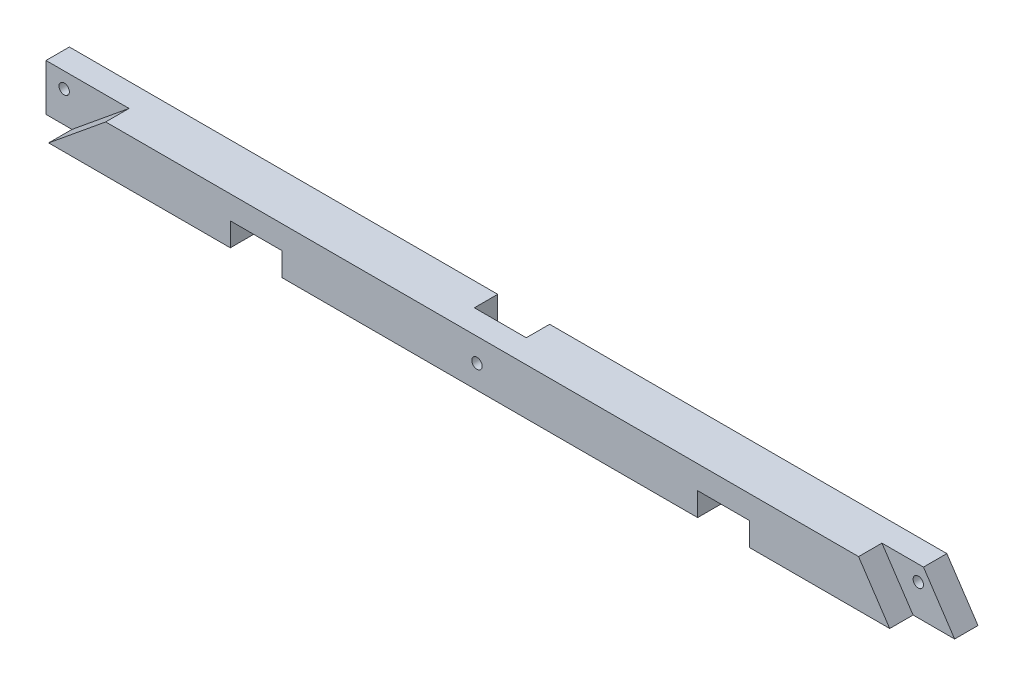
ISO-10303-21;
HEADER;
FILE_DESCRIPTION(('STEP AP214'),'2;1');
FILE_NAME('part.step','',(''),(''),'','','');
FILE_SCHEMA(('AUTOMOTIVE_DESIGN { 1 0 10303 214 1 1 1 1 }'));
ENDSEC;
DATA;
#1=APPLICATION_CONTEXT('core data for automotive mechanical design processes');
#2=APPLICATION_PROTOCOL_DEFINITION('international standard','automotive_design',2000,#1);
#3=PRODUCT_CONTEXT('',#1,'mechanical');
#4=PRODUCT('Part','Part','',(#3));
#5=PRODUCT_RELATED_PRODUCT_CATEGORY('part','',(#4));
#6=PRODUCT_DEFINITION_FORMATION('','',#4);
#7=PRODUCT_DEFINITION_CONTEXT('part definition',#1,'design');
#8=PRODUCT_DEFINITION('design','',#6,#7);
#9=PRODUCT_DEFINITION_SHAPE('','',#8);
#10=(LENGTH_UNIT() NAMED_UNIT(*) SI_UNIT(.MILLI.,.METRE.));
#11=(NAMED_UNIT(*) PLANE_ANGLE_UNIT() SI_UNIT($,.RADIAN.));
#12=(NAMED_UNIT(*) SI_UNIT($,.STERADIAN.) SOLID_ANGLE_UNIT());
#13=UNCERTAINTY_MEASURE_WITH_UNIT(LENGTH_MEASURE(1.E-05),#10,'distance_accuracy_value','');
#14=(GEOMETRIC_REPRESENTATION_CONTEXT(3) GLOBAL_UNCERTAINTY_ASSIGNED_CONTEXT((#13)) GLOBAL_UNIT_ASSIGNED_CONTEXT((#10,
#11,#12)) REPRESENTATION_CONTEXT('',''));
#15=CARTESIAN_POINT('',(0.,0.,0.));
#16=DIRECTION('',(0.,0.,1.));
#17=DIRECTION('',(1.,0.,0.));
#18=AXIS2_PLACEMENT_3D('',#15,#16,#17);
#19=CARTESIAN_POINT('',(0.,0.,9.));
#20=DIRECTION('',(0.,1.,0.));
#21=DIRECTION('',(0.,0.,1.));
#22=AXIS2_PLACEMENT_3D('',#19,#20,#21);
#23=PLANE('',#22);
#24=DIRECTION('',(1.,0.,0.));
#25=VECTOR('',#24,1.);
#26=CARTESIAN_POINT('',(0.,0.,0.));
#27=LINE('',#26,#25);
#28=CARTESIAN_POINT('',(92.5,0.,0.));
#29=VERTEX_POINT('',#28);
#30=CARTESIAN_POINT('',(130.,0.,0.));
#31=VERTEX_POINT('',#30);
#32=EDGE_CURVE('E329',#29,#31,#27,.T.);
#33=ORIENTED_EDGE('',*,*,#32,.T.);
#34=DIRECTION('',(0.,0.,-1.));
#35=VECTOR('',#34,1.);
#36=CARTESIAN_POINT('',(130.,0.,9.));
#37=LINE('',#36,#35);
#38=CARTESIAN_POINT('',(130.,0.,9.));
#39=VERTEX_POINT('',#38);
#40=EDGE_CURVE('E197',#39,#31,#37,.T.);
#41=ORIENTED_EDGE('',*,*,#40,.F.);
#42=DIRECTION('',(1.,0.,0.));
#43=VECTOR('',#42,1.);
#44=CARTESIAN_POINT('',(0.,0.,9.));
#45=LINE('',#44,#43);
#46=CARTESIAN_POINT('',(50.,0.,9.));
#47=VERTEX_POINT('',#46);
#48=EDGE_CURVE('E188',#47,#39,#45,.T.);
#49=ORIENTED_EDGE('',*,*,#48,.F.);
#50=DIRECTION('',(0.,0.,-1.));
#51=VECTOR('',#50,1.);
#52=CARTESIAN_POINT('',(50.,0.,9.));
#53=LINE('',#52,#51);
#54=CARTESIAN_POINT('',(50.,0.,0.));
#55=VERTEX_POINT('',#54);
#56=EDGE_CURVE('E221',#47,#55,#53,.T.);
#57=ORIENTED_EDGE('',*,*,#56,.T.);
#58=CARTESIAN_POINT('',(82.5,0.,0.));
#59=VERTEX_POINT('',#58);
#60=EDGE_CURVE('E328',#55,#59,#27,.T.);
#61=ORIENTED_EDGE('',*,*,#60,.T.);
#62=DIRECTION('',(0.,0.,-1.));
#63=VECTOR('',#62,1.);
#64=CARTESIAN_POINT('',(82.5,0.,4.5));
#65=LINE('',#64,#63);
#66=CARTESIAN_POINT('',(82.5,0.,4.5));
#67=VERTEX_POINT('',#66);
#68=EDGE_CURVE('E255',#67,#59,#65,.T.);
#69=ORIENTED_EDGE('',*,*,#68,.F.);
#70=DIRECTION('',(-1.,0.,0.));
#71=VECTOR('',#70,1.);
#72=CARTESIAN_POINT('',(92.5,0.,4.5));
#73=LINE('',#72,#71);
#74=CARTESIAN_POINT('',(92.5,0.,4.5));
#75=VERTEX_POINT('',#74);
#76=EDGE_CURVE('E236',#75,#67,#73,.T.);
#77=ORIENTED_EDGE('',*,*,#76,.F.);
#78=DIRECTION('',(0.,0.,-1.));
#79=VECTOR('',#78,1.);
#80=CARTESIAN_POINT('',(92.5,0.,4.5));
#81=LINE('',#80,#79);
#82=EDGE_CURVE('E246',#75,#29,#81,.T.);
#83=ORIENTED_EDGE('',*,*,#82,.T.);
#84=EDGE_LOOP('',(#33,#41,#49,#57,#61,#69,#77,#83));
#85=FACE_BOUND('',#84,.T.);
#86=ADVANCED_FACE('F30',(#85),#23,.F.);
#87=CARTESIAN_POINT('',(0.,0.,0.));
#88=VERTEX_POINT('',#87);
#89=CARTESIAN_POINT('',(40.,0.,0.));
#90=VERTEX_POINT('',#89);
#91=EDGE_CURVE('E324',#88,#90,#27,.T.);
#92=ORIENTED_EDGE('',*,*,#91,.T.);
#93=DIRECTION('',(0.,0.,-1.));
#94=VECTOR('',#93,1.);
#95=CARTESIAN_POINT('',(40.,0.,9.));
#96=LINE('',#95,#94);
#97=CARTESIAN_POINT('',(40.,0.,9.));
#98=VERTEX_POINT('',#97);
#99=EDGE_CURVE('E218',#98,#90,#96,.T.);
#100=ORIENTED_EDGE('',*,*,#99,.F.);
#101=CARTESIAN_POINT('',(5.,0.,9.));
#102=VERTEX_POINT('',#101);
#103=EDGE_CURVE('E314',#102,#98,#45,.T.);
#104=ORIENTED_EDGE('',*,*,#103,.F.);
#105=DIRECTION('',(0.,0.,1.));
#106=VECTOR('',#105,1.);
#107=CARTESIAN_POINT('',(5.,0.,4.5));
#108=LINE('',#107,#106);
#109=CARTESIAN_POINT('',(5.,0.,4.5));
#110=VERTEX_POINT('',#109);
#111=EDGE_CURVE('E306',#110,#102,#108,.T.);
#112=ORIENTED_EDGE('',*,*,#111,.F.);
#113=DIRECTION('',(1.,0.,0.));
#114=VECTOR('',#113,1.);
#115=CARTESIAN_POINT('',(5.,0.,4.5));
#116=LINE('',#115,#114);
#117=CARTESIAN_POINT('',(0.,0.,4.5));
#118=VERTEX_POINT('',#117);
#119=EDGE_CURVE('E298',#118,#110,#116,.T.);
#120=ORIENTED_EDGE('',*,*,#119,.F.);
#121=DIRECTION('',(0.,0.,-1.));
#122=VECTOR('',#121,1.);
#123=CARTESIAN_POINT('',(0.,0.,9.));
#124=LINE('',#123,#122);
#125=EDGE_CURVE('E11',#118,#88,#124,.T.);
#126=ORIENTED_EDGE('',*,*,#125,.T.);
#127=EDGE_LOOP('',(#92,#100,#104,#112,#120,#126));
#128=FACE_BOUND('',#127,.T.);
#129=ADVANCED_FACE('F377',(#128),#23,.F.);
#130=CARTESIAN_POINT('',(0.,9.,0.));
#131=DIRECTION('',(0.,0.,-1.));
#132=DIRECTION('',(-1.,0.,0.));
#133=AXIS2_PLACEMENT_3D('',#130,#131,#132);
#134=PLANE('',#133);
#135=DIRECTION('',(0.,1.,0.));
#136=VECTOR('',#135,1.);
#137=CARTESIAN_POINT('',(130.,0.,0.));
#138=LINE('',#137,#136);
#139=CARTESIAN_POINT('',(130.,4.5,0.));
#140=VERTEX_POINT('',#139);
#141=EDGE_CURVE('E172',#31,#140,#138,.T.);
#142=ORIENTED_EDGE('',*,*,#141,.F.);
#143=ORIENTED_EDGE('',*,*,#32,.F.);
#144=DIRECTION('',(0.,-1.,0.));
#145=VECTOR('',#144,1.);
#146=CARTESIAN_POINT('',(92.5,0.,0.));
#147=LINE('',#146,#145);
#148=CARTESIAN_POINT('',(92.5,9.,0.));
#149=VERTEX_POINT('',#148);
#150=EDGE_CURVE('E230',#149,#29,#147,.T.);
#151=ORIENTED_EDGE('',*,*,#150,.F.);
#152=DIRECTION('',(-1.,0.,0.));
#153=VECTOR('',#152,1.);
#154=CARTESIAN_POINT('',(0.,9.,0.));
#155=LINE('',#154,#153);
#156=CARTESIAN_POINT('',(169.,9.,0.));
#157=VERTEX_POINT('',#156);
#158=EDGE_CURVE('E330',#157,#149,#155,.T.);
#159=ORIENTED_EDGE('',*,*,#158,.F.);
#160=DIRECTION('',(0.55470019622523,-0.832050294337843,0.));
#161=VECTOR('',#160,1.);
#162=CARTESIAN_POINT('',(169.,9.,0.));
#163=LINE('',#162,#161);
#164=CARTESIAN_POINT('',(175.,0.,0.));
#165=VERTEX_POINT('',#164);
#166=EDGE_CURVE('E282',#157,#165,#163,.T.);
#167=ORIENTED_EDGE('',*,*,#166,.T.);
#168=CARTESIAN_POINT('',(140.,0.,0.));
#169=VERTEX_POINT('',#168);
#170=EDGE_CURVE('E323',#169,#165,#27,.T.);
#171=ORIENTED_EDGE('',*,*,#170,.F.);
#172=DIRECTION('',(0.,-1.,0.));
#173=VECTOR('',#172,1.);
#174=CARTESIAN_POINT('',(140.,0.,0.));
#175=LINE('',#174,#173);
#176=CARTESIAN_POINT('',(140.,4.5,0.));
#177=VERTEX_POINT('',#176);
#178=EDGE_CURVE('E189',#177,#169,#175,.T.);
#179=ORIENTED_EDGE('',*,*,#178,.F.);
#180=DIRECTION('',(1.,0.,0.));
#181=VECTOR('',#180,1.);
#182=CARTESIAN_POINT('',(130.,4.5,0.));
#183=LINE('',#182,#181);
#184=EDGE_CURVE('E191',#140,#177,#183,.T.);
#185=ORIENTED_EDGE('',*,*,#184,.F.);
#186=EDGE_LOOP('',(#142,#143,#151,#159,#167,#171,#179,#185));
#187=FACE_BOUND('',#186,.T.);
#188=CARTESIAN_POINT('',(168.,6.,0.));
#189=DIRECTION('',(0.,0.,1.));
#190=DIRECTION('',(1.,0.,0.));
#191=AXIS2_PLACEMENT_3D('',#188,#189,#190);
#192=CIRCLE('',#191,0.999999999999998);
#193=CARTESIAN_POINT('',(169.,6.,0.));
#194=VERTEX_POINT('',#193);
#195=EDGE_CURVE('E260',#194,#194,#192,.T.);
#196=ORIENTED_EDGE('',*,*,#195,.T.);
#197=EDGE_LOOP('',(#196));
#198=FACE_BOUND('',#197,.T.);
#199=ADVANCED_FACE('F345',(#187,#198),#134,.T.);
#200=CARTESIAN_POINT('',(169.,9.,0.));
#201=DIRECTION('',(-0.832050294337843,-0.554700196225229,0.));
#202=DIRECTION('',(0.554700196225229,-0.832050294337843,0.));
#203=AXIS2_PLACEMENT_3D('',#200,#201,#202);
#204=PLANE('',#203);
#205=DIRECTION('',(-0.55470019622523,0.832050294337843,0.));
#206=VECTOR('',#205,1.);
#207=CARTESIAN_POINT('',(175.,0.,4.5));
#208=LINE('',#207,#206);
#209=CARTESIAN_POINT('',(175.,0.,4.5));
#210=VERTEX_POINT('',#209);
#211=CARTESIAN_POINT('',(169.,9.,4.5));
#212=VERTEX_POINT('',#211);
#213=EDGE_CURVE('E266',#210,#212,#208,.T.);
#214=ORIENTED_EDGE('',*,*,#213,.F.);
#215=DIRECTION('',(0.,0.,-1.));
#216=VECTOR('',#215,1.);
#217=CARTESIAN_POINT('',(175.,0.,9.));
#218=LINE('',#217,#216);
#219=EDGE_CURVE('E38',#210,#165,#218,.T.);
#220=ORIENTED_EDGE('',*,*,#219,.T.);
#221=ORIENTED_EDGE('',*,*,#166,.F.);
#222=DIRECTION('',(0.,0.,1.));
#223=VECTOR('',#222,1.);
#224=CARTESIAN_POINT('',(169.,9.,0.));
#225=LINE('',#224,#223);
#226=EDGE_CURVE('E286',#157,#212,#225,.T.);
#227=ORIENTED_EDGE('',*,*,#226,.T.);
#228=EDGE_LOOP('',(#214,#220,#221,#227));
#229=FACE_BOUND('',#228,.T.);
#230=ADVANCED_FACE('F338',(#229),#204,.F.);
#231=CARTESIAN_POINT('',(0.,0.,9.));
#232=DIRECTION('',(1.,0.,0.));
#233=DIRECTION('',(0.,0.,-1.));
#234=AXIS2_PLACEMENT_3D('',#231,#232,#233);
#235=PLANE('',#234);
#236=ORIENTED_EDGE('',*,*,#125,.F.);
#237=DIRECTION('',(0.,-1.,0.));
#238=VECTOR('',#237,1.);
#239=CARTESIAN_POINT('',(0.,0.,4.5));
#240=LINE('',#239,#238);
#241=CARTESIAN_POINT('',(0.,9.,4.5));
#242=VERTEX_POINT('',#241);
#243=EDGE_CURVE('E296',#242,#118,#240,.T.);
#244=ORIENTED_EDGE('',*,*,#243,.F.);
#245=DIRECTION('',(0.,0.,-1.));
#246=VECTOR('',#245,1.);
#247=CARTESIAN_POINT('',(0.,9.,9.));
#248=LINE('',#247,#246);
#249=CARTESIAN_POINT('',(0.,9.,0.));
#250=VERTEX_POINT('',#249);
#251=EDGE_CURVE('E320',#242,#250,#248,.T.);
#252=ORIENTED_EDGE('',*,*,#251,.T.);
#253=DIRECTION('',(0.,-1.,0.));
#254=VECTOR('',#253,1.);
#255=CARTESIAN_POINT('',(0.,0.,0.));
#256=LINE('',#255,#254);
#257=EDGE_CURVE('E312',#250,#88,#256,.T.);
#258=ORIENTED_EDGE('',*,*,#257,.T.);
#259=EDGE_LOOP('',(#236,#244,#252,#258));
#260=FACE_BOUND('',#259,.T.);
#261=ADVANCED_FACE('F32',(#260),#235,.F.);
#262=CARTESIAN_POINT('',(140.,0.,9.));
#263=VERTEX_POINT('',#262);
#264=CARTESIAN_POINT('',(167.,0.,9.));
#265=VERTEX_POINT('',#264);
#266=EDGE_CURVE('E318',#263,#265,#45,.T.);
#267=ORIENTED_EDGE('',*,*,#266,.F.);
#268=DIRECTION('',(0.,0.,-1.));
#269=VECTOR('',#268,1.);
#270=CARTESIAN_POINT('',(140.,0.,9.));
#271=LINE('',#270,#269);
#272=EDGE_CURVE('E199',#263,#169,#271,.T.);
#273=ORIENTED_EDGE('',*,*,#272,.T.);
#274=ORIENTED_EDGE('',*,*,#170,.T.);
#275=ORIENTED_EDGE('',*,*,#219,.F.);
#276=DIRECTION('',(1.,0.,0.));
#277=VECTOR('',#276,1.);
#278=CARTESIAN_POINT('',(167.,0.,4.5));
#279=LINE('',#278,#277);
#280=CARTESIAN_POINT('',(167.,0.,4.5));
#281=VERTEX_POINT('',#280);
#282=EDGE_CURVE('E274',#281,#210,#279,.T.);
#283=ORIENTED_EDGE('',*,*,#282,.F.);
#284=DIRECTION('',(0.,0.,1.));
#285=VECTOR('',#284,1.);
#286=CARTESIAN_POINT('',(167.,0.,4.5));
#287=LINE('',#286,#285);
#288=EDGE_CURVE('E279',#281,#265,#287,.T.);
#289=ORIENTED_EDGE('',*,*,#288,.T.);
#290=EDGE_LOOP('',(#267,#273,#274,#275,#283,#289));
#291=FACE_BOUND('',#290,.T.);
#292=ADVANCED_FACE('F360',(#291),#23,.F.);
#293=CARTESIAN_POINT('',(0.,9.,9.));
#294=DIRECTION('',(0.,-1.,0.));
#295=DIRECTION('',(0.,0.,-1.));
#296=AXIS2_PLACEMENT_3D('',#293,#294,#295);
#297=PLANE('',#296);
#298=ORIENTED_EDGE('',*,*,#158,.T.);
#299=DIRECTION('',(0.,0.,-1.));
#300=VECTOR('',#299,1.);
#301=CARTESIAN_POINT('',(92.5,9.,4.5));
#302=LINE('',#301,#300);
#303=CARTESIAN_POINT('',(92.5,9.,4.5));
#304=VERTEX_POINT('',#303);
#305=EDGE_CURVE('E249',#304,#149,#302,.T.);
#306=ORIENTED_EDGE('',*,*,#305,.F.);
#307=DIRECTION('',(1.,0.,0.));
#308=VECTOR('',#307,1.);
#309=CARTESIAN_POINT('',(92.5,9.,4.5));
#310=LINE('',#309,#308);
#311=CARTESIAN_POINT('',(82.5,9.,4.5));
#312=VERTEX_POINT('',#311);
#313=EDGE_CURVE('E243',#312,#304,#310,.T.);
#314=ORIENTED_EDGE('',*,*,#313,.F.);
#315=DIRECTION('',(0.,0.,-1.));
#316=VECTOR('',#315,1.);
#317=CARTESIAN_POINT('',(82.5,9.,4.5));
#318=LINE('',#317,#316);
#319=CARTESIAN_POINT('',(82.5,9.,0.));
#320=VERTEX_POINT('',#319);
#321=EDGE_CURVE('E252',#312,#320,#318,.T.);
#322=ORIENTED_EDGE('',*,*,#321,.T.);
#323=EDGE_CURVE('E327',#320,#250,#155,.T.);
#324=ORIENTED_EDGE('',*,*,#323,.T.);
#325=ORIENTED_EDGE('',*,*,#251,.F.);
#326=DIRECTION('',(-1.,0.,0.));
#327=VECTOR('',#326,1.);
#328=CARTESIAN_POINT('',(0.,9.,4.5));
#329=LINE('',#328,#327);
#330=CARTESIAN_POINT('',(16.,9.,4.5));
#331=VERTEX_POINT('',#330);
#332=EDGE_CURVE('E304',#331,#242,#329,.T.);
#333=ORIENTED_EDGE('',*,*,#332,.F.);
#334=DIRECTION('',(0.,0.,1.));
#335=VECTOR('',#334,1.);
#336=CARTESIAN_POINT('',(16.,9.,4.5));
#337=LINE('',#336,#335);
#338=CARTESIAN_POINT('',(16.,9.,9.));
#339=VERTEX_POINT('',#338);
#340=EDGE_CURVE('E309',#331,#339,#337,.T.);
#341=ORIENTED_EDGE('',*,*,#340,.T.);
#342=DIRECTION('',(-1.,0.,0.));
#343=VECTOR('',#342,1.);
#344=CARTESIAN_POINT('',(0.,9.,9.));
#345=LINE('',#344,#343);
#346=CARTESIAN_POINT('',(161.,9.,9.));
#347=VERTEX_POINT('',#346);
#348=EDGE_CURVE('E317',#347,#339,#345,.T.);
#349=ORIENTED_EDGE('',*,*,#348,.F.);
#350=DIRECTION('',(0.,0.,1.));
#351=VECTOR('',#350,1.);
#352=CARTESIAN_POINT('',(161.,9.,4.5));
#353=LINE('',#352,#351);
#354=CARTESIAN_POINT('',(161.,9.,4.5));
#355=VERTEX_POINT('',#354);
#356=EDGE_CURVE('E276',#355,#347,#353,.T.);
#357=ORIENTED_EDGE('',*,*,#356,.F.);
#358=DIRECTION('',(-1.,0.,0.));
#359=VECTOR('',#358,1.);
#360=CARTESIAN_POINT('',(169.,9.,4.5));
#361=LINE('',#360,#359);
#362=EDGE_CURVE('E268',#212,#355,#361,.T.);
#363=ORIENTED_EDGE('',*,*,#362,.F.);
#364=ORIENTED_EDGE('',*,*,#226,.F.);
#365=EDGE_LOOP('',(#298,#306,#314,#322,#324,#325,#333,#341,#349,#357,#363,#364));
#366=FACE_BOUND('',#365,.T.);
#367=ADVANCED_FACE('F352',(#366),#297,.F.);
#368=CARTESIAN_POINT('',(0.,9.,9.));
#369=DIRECTION('',(0.,0.,-1.));
#370=DIRECTION('',(-1.,0.,0.));
#371=AXIS2_PLACEMENT_3D('',#368,#369,#370);
#372=PLANE('',#371);
#373=ORIENTED_EDGE('',*,*,#48,.T.);
#374=DIRECTION('',(0.,1.,0.));
#375=VECTOR('',#374,1.);
#376=CARTESIAN_POINT('',(130.,0.,9.));
#377=LINE('',#376,#375);
#378=CARTESIAN_POINT('',(130.,4.5,9.));
#379=VERTEX_POINT('',#378);
#380=EDGE_CURVE('E169',#39,#379,#377,.T.);
#381=ORIENTED_EDGE('',*,*,#380,.T.);
#382=DIRECTION('',(1.,0.,0.));
#383=VECTOR('',#382,1.);
#384=CARTESIAN_POINT('',(130.,4.5,9.));
#385=LINE('',#384,#383);
#386=CARTESIAN_POINT('',(140.,4.5,9.));
#387=VERTEX_POINT('',#386);
#388=EDGE_CURVE('E179',#379,#387,#385,.T.);
#389=ORIENTED_EDGE('',*,*,#388,.T.);
#390=DIRECTION('',(0.,-1.,0.));
#391=VECTOR('',#390,1.);
#392=CARTESIAN_POINT('',(140.,0.,9.));
#393=LINE('',#392,#391);
#394=EDGE_CURVE('E45',#387,#263,#393,.T.);
#395=ORIENTED_EDGE('',*,*,#394,.T.);
#396=ORIENTED_EDGE('',*,*,#266,.T.);
#397=DIRECTION('',(0.55470019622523,-0.832050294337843,0.));
#398=VECTOR('',#397,1.);
#399=CARTESIAN_POINT('',(161.,9.,9.));
#400=LINE('',#399,#398);
#401=EDGE_CURVE('E263',#347,#265,#400,.T.);
#402=ORIENTED_EDGE('',*,*,#401,.F.);
#403=ORIENTED_EDGE('',*,*,#348,.T.);
#404=DIRECTION('',(0.773957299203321,0.633237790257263,0.));
#405=VECTOR('',#404,1.);
#406=CARTESIAN_POINT('',(16.,9.,9.));
#407=LINE('',#406,#405);
#408=EDGE_CURVE('E293',#102,#339,#407,.T.);
#409=ORIENTED_EDGE('',*,*,#408,.F.);
#410=ORIENTED_EDGE('',*,*,#103,.T.);
#411=DIRECTION('',(0.,1.,0.));
#412=VECTOR('',#411,1.);
#413=CARTESIAN_POINT('',(40.,0.,9.));
#414=LINE('',#413,#412);
#415=CARTESIAN_POINT('',(40.,4.5,9.));
#416=VERTEX_POINT('',#415);
#417=EDGE_CURVE('E203',#98,#416,#414,.T.);
#418=ORIENTED_EDGE('',*,*,#417,.T.);
#419=DIRECTION('',(1.,0.,0.));
#420=VECTOR('',#419,1.);
#421=CARTESIAN_POINT('',(40.,4.5,9.));
#422=LINE('',#421,#420);
#423=CARTESIAN_POINT('',(50.,4.5,9.));
#424=VERTEX_POINT('',#423);
#425=EDGE_CURVE('E206',#416,#424,#422,.T.);
#426=ORIENTED_EDGE('',*,*,#425,.T.);
#427=DIRECTION('',(0.,-1.,0.));
#428=VECTOR('',#427,1.);
#429=CARTESIAN_POINT('',(50.,0.,9.));
#430=LINE('',#429,#428);
#431=EDGE_CURVE('E210',#424,#47,#430,.T.);
#432=ORIENTED_EDGE('',*,*,#431,.T.);
#433=EDGE_LOOP('',(#373,#381,#389,#395,#396,#402,#403,#409,#410,#418,#426,#432));
#434=FACE_BOUND('',#433,.T.);
#435=CARTESIAN_POINT('',(87.5,4.5,9.));
#436=DIRECTION('',(0.,0.,-1.));
#437=DIRECTION('',(-1.,0.,0.));
#438=AXIS2_PLACEMENT_3D('',#435,#436,#437);
#439=CIRCLE('',#438,0.999999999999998);
#440=CARTESIAN_POINT('',(86.5,4.5,9.));
#441=VERTEX_POINT('',#440);
#442=EDGE_CURVE('E227',#441,#441,#439,.T.);
#443=ORIENTED_EDGE('',*,*,#442,.T.);
#444=EDGE_LOOP('',(#443));
#445=FACE_BOUND('',#444,.T.);
#446=ADVANCED_FACE('F184',(#434,#445),#372,.F.);
#447=DIRECTION('',(0.,1.,0.));
#448=VECTOR('',#447,1.);
#449=CARTESIAN_POINT('',(40.,0.,0.));
#450=LINE('',#449,#448);
#451=CARTESIAN_POINT('',(40.,4.5,0.));
#452=VERTEX_POINT('',#451);
#453=EDGE_CURVE('E53',#90,#452,#450,.T.);
#454=ORIENTED_EDGE('',*,*,#453,.F.);
#455=ORIENTED_EDGE('',*,*,#91,.F.);
#456=ORIENTED_EDGE('',*,*,#257,.F.);
#457=ORIENTED_EDGE('',*,*,#323,.F.);
#458=DIRECTION('',(0.,1.,0.));
#459=VECTOR('',#458,1.);
#460=CARTESIAN_POINT('',(82.5,0.,0.));
#461=LINE('',#460,#459);
#462=EDGE_CURVE('E237',#59,#320,#461,.T.);
#463=ORIENTED_EDGE('',*,*,#462,.F.);
#464=ORIENTED_EDGE('',*,*,#60,.F.);
#465=DIRECTION('',(0.,-1.,0.));
#466=VECTOR('',#465,1.);
#467=CARTESIAN_POINT('',(50.,0.,0.));
#468=LINE('',#467,#466);
#469=CARTESIAN_POINT('',(50.,4.5,0.));
#470=VERTEX_POINT('',#469);
#471=EDGE_CURVE('E207',#470,#55,#468,.T.);
#472=ORIENTED_EDGE('',*,*,#471,.F.);
#473=DIRECTION('',(1.,0.,0.));
#474=VECTOR('',#473,1.);
#475=CARTESIAN_POINT('',(40.,4.5,0.));
#476=LINE('',#475,#474);
#477=EDGE_CURVE('E214',#452,#470,#476,.T.);
#478=ORIENTED_EDGE('',*,*,#477,.F.);
#479=EDGE_LOOP('',(#454,#455,#456,#457,#463,#464,#472,#478));
#480=FACE_BOUND('',#479,.T.);
#481=CARTESIAN_POINT('',(3.5,6.,0.));
#482=DIRECTION('',(0.,0.,1.));
#483=DIRECTION('',(1.,0.,0.));
#484=AXIS2_PLACEMENT_3D('',#481,#482,#483);
#485=CIRCLE('',#484,1.);
#486=CARTESIAN_POINT('',(4.5,6.,0.));
#487=VERTEX_POINT('',#486);
#488=EDGE_CURVE('E290',#487,#487,#485,.T.);
#489=ORIENTED_EDGE('',*,*,#488,.T.);
#490=EDGE_LOOP('',(#489));
#491=FACE_BOUND('',#490,.T.);
#492=ADVANCED_FACE('F384',(#480,#491),#134,.T.);
#493=CARTESIAN_POINT('',(16.,9.,4.5));
#494=DIRECTION('',(0.633237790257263,-0.773957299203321,0.));
#495=DIRECTION('',(0.773957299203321,0.633237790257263,0.));
#496=AXIS2_PLACEMENT_3D('',#493,#494,#495);
#497=PLANE('',#496);
#498=ORIENTED_EDGE('',*,*,#408,.T.);
#499=ORIENTED_EDGE('',*,*,#340,.F.);
#500=DIRECTION('',(0.773957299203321,0.633237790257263,0.));
#501=VECTOR('',#500,1.);
#502=CARTESIAN_POINT('',(16.,9.,4.5));
#503=LINE('',#502,#501);
#504=EDGE_CURVE('E301',#110,#331,#503,.T.);
#505=ORIENTED_EDGE('',*,*,#504,.F.);
#506=ORIENTED_EDGE('',*,*,#111,.T.);
#507=EDGE_LOOP('',(#498,#499,#505,#506));
#508=FACE_BOUND('',#507,.T.);
#509=ADVANCED_FACE('F368',(#508),#497,.F.);
#510=CARTESIAN_POINT('',(0.,9.,4.5));
#511=DIRECTION('',(0.,0.,-1.));
#512=DIRECTION('',(-1.,0.,0.));
#513=AXIS2_PLACEMENT_3D('',#510,#511,#512);
#514=PLANE('',#513);
#515=CARTESIAN_POINT('',(3.5,6.,4.5));
#516=DIRECTION('',(0.,0.,1.));
#517=DIRECTION('',(1.,0.,0.));
#518=AXIS2_PLACEMENT_3D('',#515,#516,#517);
#519=CIRCLE('',#518,1.);
#520=CARTESIAN_POINT('',(4.5,6.,4.5));
#521=VERTEX_POINT('',#520);
#522=EDGE_CURVE('E289',#521,#521,#519,.T.);
#523=ORIENTED_EDGE('',*,*,#522,.F.);
#524=EDGE_LOOP('',(#523));
#525=FACE_BOUND('',#524,.T.);
#526=ORIENTED_EDGE('',*,*,#243,.T.);
#527=ORIENTED_EDGE('',*,*,#119,.T.);
#528=ORIENTED_EDGE('',*,*,#504,.T.);
#529=ORIENTED_EDGE('',*,*,#332,.T.);
#530=EDGE_LOOP('',(#526,#527,#528,#529));
#531=FACE_BOUND('',#530,.T.);
#532=ADVANCED_FACE('F370',(#525,#531),#514,.F.);
#533=CARTESIAN_POINT('',(3.5,6.,0.));
#534=DIRECTION('',(0.,0.,1.));
#535=DIRECTION('',(1.,0.,0.));
#536=AXIS2_PLACEMENT_3D('',#533,#534,#535);
#537=CYLINDRICAL_SURFACE('',#536,1.);
#538=ORIENTED_EDGE('',*,*,#488,.F.);
#539=EDGE_LOOP('',(#538));
#540=FACE_BOUND('',#539,.T.);
#541=ORIENTED_EDGE('',*,*,#522,.T.);
#542=EDGE_LOOP('',(#541));
#543=FACE_BOUND('',#542,.T.);
#544=ADVANCED_FACE('F436',(#540,#543),#537,.F.);
#545=CARTESIAN_POINT('',(161.,9.,4.5));
#546=DIRECTION('',(-0.832050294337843,-0.554700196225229,0.));
#547=DIRECTION('',(0.554700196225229,-0.832050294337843,0.));
#548=AXIS2_PLACEMENT_3D('',#545,#546,#547);
#549=PLANE('',#548);
#550=ORIENTED_EDGE('',*,*,#401,.T.);
#551=ORIENTED_EDGE('',*,*,#288,.F.);
#552=DIRECTION('',(0.55470019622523,-0.832050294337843,0.));
#553=VECTOR('',#552,1.);
#554=CARTESIAN_POINT('',(161.,9.,4.5));
#555=LINE('',#554,#553);
#556=EDGE_CURVE('E271',#355,#281,#555,.T.);
#557=ORIENTED_EDGE('',*,*,#556,.F.);
#558=ORIENTED_EDGE('',*,*,#356,.T.);
#559=EDGE_LOOP('',(#550,#551,#557,#558));
#560=FACE_BOUND('',#559,.T.);
#561=ADVANCED_FACE('F362',(#560),#549,.F.);
#562=CARTESIAN_POINT('',(169.,9.,4.5));
#563=DIRECTION('',(0.,0.,1.));
#564=DIRECTION('',(1.,0.,0.));
#565=AXIS2_PLACEMENT_3D('',#562,#563,#564);
#566=PLANE('',#565);
#567=CARTESIAN_POINT('',(168.,6.,4.5));
#568=DIRECTION('',(0.,0.,1.));
#569=DIRECTION('',(1.,0.,0.));
#570=AXIS2_PLACEMENT_3D('',#567,#568,#569);
#571=CIRCLE('',#570,0.999999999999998);
#572=CARTESIAN_POINT('',(169.,6.,4.5));
#573=VERTEX_POINT('',#572);
#574=EDGE_CURVE('E251',#573,#573,#571,.T.);
#575=ORIENTED_EDGE('',*,*,#574,.F.);
#576=EDGE_LOOP('',(#575));
#577=FACE_BOUND('',#576,.T.);
#578=ORIENTED_EDGE('',*,*,#213,.T.);
#579=ORIENTED_EDGE('',*,*,#362,.T.);
#580=ORIENTED_EDGE('',*,*,#556,.T.);
#581=ORIENTED_EDGE('',*,*,#282,.T.);
#582=EDGE_LOOP('',(#578,#579,#580,#581));
#583=FACE_BOUND('',#582,.T.);
#584=ADVANCED_FACE('F358',(#577,#583),#566,.T.);
#585=CARTESIAN_POINT('',(168.,6.,0.));
#586=DIRECTION('',(0.,0.,1.));
#587=DIRECTION('',(1.,0.,0.));
#588=AXIS2_PLACEMENT_3D('',#585,#586,#587);
#589=CYLINDRICAL_SURFACE('',#588,0.999999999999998);
#590=ORIENTED_EDGE('',*,*,#195,.F.);
#591=EDGE_LOOP('',(#590));
#592=FACE_BOUND('',#591,.T.);
#593=ORIENTED_EDGE('',*,*,#574,.T.);
#594=EDGE_LOOP('',(#593));
#595=FACE_BOUND('',#594,.T.);
#596=ADVANCED_FACE('F475',(#592,#595),#589,.F.);
#597=CARTESIAN_POINT('',(92.5,0.,4.5));
#598=DIRECTION('',(1.,0.,0.));
#599=DIRECTION('',(0.,0.,-1.));
#600=AXIS2_PLACEMENT_3D('',#597,#598,#599);
#601=PLANE('',#600);
#602=ORIENTED_EDGE('',*,*,#150,.T.);
#603=ORIENTED_EDGE('',*,*,#82,.F.);
#604=DIRECTION('',(0.,-1.,0.));
#605=VECTOR('',#604,1.);
#606=CARTESIAN_POINT('',(92.5,0.,4.5));
#607=LINE('',#606,#605);
#608=EDGE_CURVE('E233',#304,#75,#607,.T.);
#609=ORIENTED_EDGE('',*,*,#608,.F.);
#610=ORIENTED_EDGE('',*,*,#305,.T.);
#611=EDGE_LOOP('',(#602,#603,#609,#610));
#612=FACE_BOUND('',#611,.T.);
#613=ADVANCED_FACE('F400',(#612),#601,.F.);
#614=CARTESIAN_POINT('',(82.5,0.,4.5));
#615=DIRECTION('',(-1.,0.,0.));
#616=DIRECTION('',(0.,0.,1.));
#617=AXIS2_PLACEMENT_3D('',#614,#615,#616);
#618=PLANE('',#617);
#619=ORIENTED_EDGE('',*,*,#462,.T.);
#620=ORIENTED_EDGE('',*,*,#321,.F.);
#621=DIRECTION('',(0.,1.,0.));
#622=VECTOR('',#621,1.);
#623=CARTESIAN_POINT('',(82.5,0.,4.5));
#624=LINE('',#623,#622);
#625=EDGE_CURVE('E240',#67,#312,#624,.T.);
#626=ORIENTED_EDGE('',*,*,#625,.F.);
#627=ORIENTED_EDGE('',*,*,#68,.T.);
#628=EDGE_LOOP('',(#619,#620,#626,#627));
#629=FACE_BOUND('',#628,.T.);
#630=ADVANCED_FACE('F393',(#629),#618,.F.);
#631=CARTESIAN_POINT('',(92.5,9.,4.5));
#632=DIRECTION('',(0.,0.,1.));
#633=DIRECTION('',(1.,0.,0.));
#634=AXIS2_PLACEMENT_3D('',#631,#632,#633);
#635=PLANE('',#634);
#636=CARTESIAN_POINT('',(87.5,4.5,4.5));
#637=DIRECTION('',(0.,0.,-1.));
#638=DIRECTION('',(-1.,0.,0.));
#639=AXIS2_PLACEMENT_3D('',#636,#637,#638);
#640=CIRCLE('',#639,0.999999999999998);
#641=CARTESIAN_POINT('',(86.5,4.5,4.5));
#642=VERTEX_POINT('',#641);
#643=EDGE_CURVE('E220',#642,#642,#640,.T.);
#644=ORIENTED_EDGE('',*,*,#643,.F.);
#645=EDGE_LOOP('',(#644));
#646=FACE_BOUND('',#645,.T.);
#647=ORIENTED_EDGE('',*,*,#608,.T.);
#648=ORIENTED_EDGE('',*,*,#76,.T.);
#649=ORIENTED_EDGE('',*,*,#625,.T.);
#650=ORIENTED_EDGE('',*,*,#313,.T.);
#651=EDGE_LOOP('',(#647,#648,#649,#650));
#652=FACE_BOUND('',#651,.T.);
#653=ADVANCED_FACE('F402',(#646,#652),#635,.F.);
#654=CARTESIAN_POINT('',(87.5,4.5,9.));
#655=DIRECTION('',(0.,0.,-1.));
#656=DIRECTION('',(-1.,0.,0.));
#657=AXIS2_PLACEMENT_3D('',#654,#655,#656);
#658=CYLINDRICAL_SURFACE('',#657,0.999999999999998);
#659=ORIENTED_EDGE('',*,*,#442,.F.);
#660=EDGE_LOOP('',(#659));
#661=FACE_BOUND('',#660,.T.);
#662=ORIENTED_EDGE('',*,*,#643,.T.);
#663=EDGE_LOOP('',(#662));
#664=FACE_BOUND('',#663,.T.);
#665=ADVANCED_FACE('F404',(#661,#664),#658,.F.);
#666=CARTESIAN_POINT('',(40.,0.,9.));
#667=DIRECTION('',(-1.,0.,0.));
#668=DIRECTION('',(0.,0.,1.));
#669=AXIS2_PLACEMENT_3D('',#666,#667,#668);
#670=PLANE('',#669);
#671=ORIENTED_EDGE('',*,*,#453,.T.);
#672=DIRECTION('',(0.,0.,-1.));
#673=VECTOR('',#672,1.);
#674=CARTESIAN_POINT('',(40.,4.5,9.));
#675=LINE('',#674,#673);
#676=EDGE_CURVE('E212',#416,#452,#675,.T.);
#677=ORIENTED_EDGE('',*,*,#676,.F.);
#678=ORIENTED_EDGE('',*,*,#417,.F.);
#679=ORIENTED_EDGE('',*,*,#99,.T.);
#680=EDGE_LOOP('',(#671,#677,#678,#679));
#681=FACE_BOUND('',#680,.T.);
#682=ADVANCED_FACE('F380',(#681),#670,.F.);
#683=CARTESIAN_POINT('',(50.,0.,9.));
#684=DIRECTION('',(1.,0.,0.));
#685=DIRECTION('',(0.,0.,-1.));
#686=AXIS2_PLACEMENT_3D('',#683,#684,#685);
#687=PLANE('',#686);
#688=ORIENTED_EDGE('',*,*,#471,.T.);
#689=ORIENTED_EDGE('',*,*,#56,.F.);
#690=ORIENTED_EDGE('',*,*,#431,.F.);
#691=DIRECTION('',(0.,0.,-1.));
#692=VECTOR('',#691,1.);
#693=CARTESIAN_POINT('',(50.,4.5,9.));
#694=LINE('',#693,#692);
#695=EDGE_CURVE('E224',#424,#470,#694,.T.);
#696=ORIENTED_EDGE('',*,*,#695,.T.);
#697=EDGE_LOOP('',(#688,#689,#690,#696));
#698=FACE_BOUND('',#697,.T.);
#699=ADVANCED_FACE('F566',(#698),#687,.F.);
#700=CARTESIAN_POINT('',(40.,4.5,9.));
#701=DIRECTION('',(0.,1.,0.));
#702=DIRECTION('',(-1.,0.,0.));
#703=AXIS2_PLACEMENT_3D('',#700,#701,#702);
#704=PLANE('',#703);
#705=ORIENTED_EDGE('',*,*,#477,.T.);
#706=ORIENTED_EDGE('',*,*,#695,.F.);
#707=ORIENTED_EDGE('',*,*,#425,.F.);
#708=ORIENTED_EDGE('',*,*,#676,.T.);
#709=EDGE_LOOP('',(#705,#706,#707,#708));
#710=FACE_BOUND('',#709,.T.);
#711=ADVANCED_FACE('F574',(#710),#704,.F.);
#712=CARTESIAN_POINT('',(130.,0.,9.));
#713=DIRECTION('',(-1.,0.,0.));
#714=DIRECTION('',(0.,0.,1.));
#715=AXIS2_PLACEMENT_3D('',#712,#713,#714);
#716=PLANE('',#715);
#717=ORIENTED_EDGE('',*,*,#141,.T.);
#718=DIRECTION('',(0.,0.,-1.));
#719=VECTOR('',#718,1.);
#720=CARTESIAN_POINT('',(130.,4.5,9.));
#721=LINE('',#720,#719);
#722=EDGE_CURVE('E165',#379,#140,#721,.T.);
#723=ORIENTED_EDGE('',*,*,#722,.F.);
#724=ORIENTED_EDGE('',*,*,#380,.F.);
#725=ORIENTED_EDGE('',*,*,#40,.T.);
#726=EDGE_LOOP('',(#717,#723,#724,#725));
#727=FACE_BOUND('',#726,.T.);
#728=ADVANCED_FACE('F167',(#727),#716,.F.);
#729=CARTESIAN_POINT('',(140.,0.,9.));
#730=DIRECTION('',(1.,0.,0.));
#731=DIRECTION('',(0.,0.,-1.));
#732=AXIS2_PLACEMENT_3D('',#729,#730,#731);
#733=PLANE('',#732);
#734=ORIENTED_EDGE('',*,*,#178,.T.);
#735=ORIENTED_EDGE('',*,*,#272,.F.);
#736=ORIENTED_EDGE('',*,*,#394,.F.);
#737=DIRECTION('',(0.,0.,-1.));
#738=VECTOR('',#737,1.);
#739=CARTESIAN_POINT('',(140.,4.5,9.));
#740=LINE('',#739,#738);
#741=EDGE_CURVE('E176',#387,#177,#740,.T.);
#742=ORIENTED_EDGE('',*,*,#741,.T.);
#743=EDGE_LOOP('',(#734,#735,#736,#742));
#744=FACE_BOUND('',#743,.T.);
#745=ADVANCED_FACE('F398',(#744),#733,.F.);
#746=CARTESIAN_POINT('',(130.,4.5,9.));
#747=DIRECTION('',(0.,1.,0.));
#748=DIRECTION('',(-1.,0.,0.));
#749=AXIS2_PLACEMENT_3D('',#746,#747,#748);
#750=PLANE('',#749);
#751=ORIENTED_EDGE('',*,*,#184,.T.);
#752=ORIENTED_EDGE('',*,*,#741,.F.);
#753=ORIENTED_EDGE('',*,*,#388,.F.);
#754=ORIENTED_EDGE('',*,*,#722,.T.);
#755=EDGE_LOOP('',(#751,#752,#753,#754));
#756=FACE_BOUND('',#755,.T.);
#757=ADVANCED_FACE('F180',(#756),#750,.F.);
#758=CLOSED_SHELL('',(#86,#129,#199,#230,#261,#292,#367,#446,#492,#509,#532,#544,#561,#584,#596,
#613,#630,#653,#665,#682,#699,#711,#728,#745,#757));
#759=MANIFOLD_SOLID_BREP('B2',#758);
#760=ADVANCED_BREP_SHAPE_REPRESENTATION('',(#18,#759),#14);
#761=SHAPE_DEFINITION_REPRESENTATION(#9,#760);
ENDSEC;
END-ISO-10303-21;
